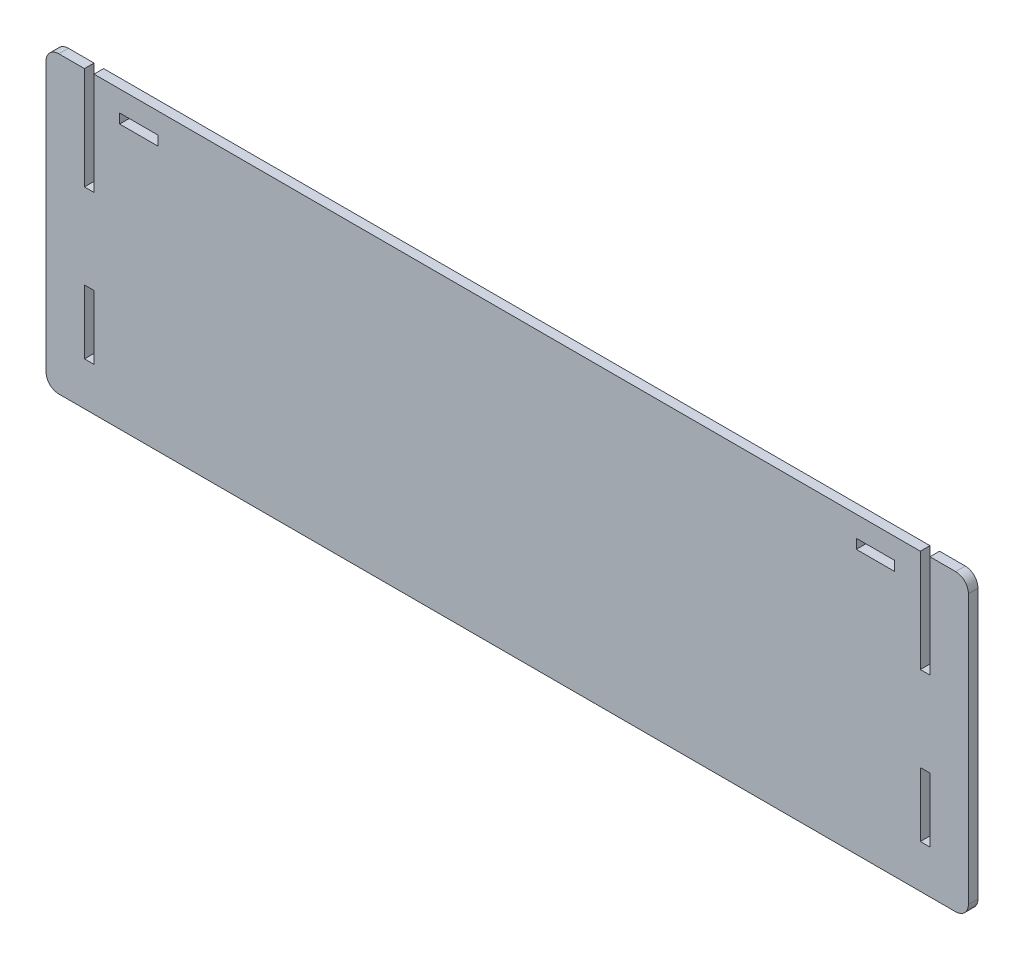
from build123d import *

# Parameters (mm, degrees)
SKETCH2_W           = 1828.8
SKETCH2_H           = 584.2
BOSS_EXTRUDE1_DEPTH = 19.05
SKETCH3_W           = 19.05
SKETCH3_H           = 203.2
CUT_EXTRUDE1_DEPTH  = 961.110760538
FILLET1_R           = 25.4
SKETCH6_W           = 19.05
SKETCH6_H           = 127
CUT_EXTRUDE4_DEPTH  = 961.110760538
SKETCH7_W           = 76.2
SKETCH7_H           = 19.05
CUT_EXTRUDE5_DEPTH  = 961.110760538


with BuildPart() as part:
    # Sketch2 → Boss-Extrude1 (new body)
    with BuildSketch(Plane.XY):
        Rectangle(SKETCH2_W, SKETCH2_H)
    extrude(amount=BOSS_EXTRUDE1_DEPTH)

    # Sketch3 → Cut-Extrude1 (cut, through all)
    with BuildSketch(Plane(origin=(0, 0, 0), x_dir=(-1, 0, 0), z_dir=(0, 0, -1))):
        with Locations((-828.675, 190.5)):
            Rectangle(SKETCH3_W, SKETCH3_H)
    cut_extrude1 = extrude(amount=-CUT_EXTRUDE1_DEPTH, mode=Mode.SUBTRACT)

    # Fillet1
    fillet1_edges = [part.edges().sort_by_distance(p)[0] for p in [
        (914.4, -292.1, 9.525),
        (-914.4, -292.1, 9.525),
        (-914.4, 292.1, 9.525),
        (914.4, 292.1, 9.525),
    ]]
    fillet(fillet1_edges, radius=FILLET1_R)

    # Mirror3: Cut-Extrude1 across plane
    add(cut_extrude1.mirror(Plane(origin=(0, 0, 0), x_dir=(0, 0, 1), z_dir=(1, 0, 0))), mode=Mode.SUBTRACT)

    # Sketch6 → Cut-Extrude4 (cut, through all)
    with BuildSketch(Plane(origin=(0, 0, 0), x_dir=(-1, 0, 0), z_dir=(0, 0, -1))):
        with Locations((-828.675, -142.875)):
            Rectangle(SKETCH6_W, SKETCH6_H)
    cut_extrude4 = extrude(amount=-CUT_EXTRUDE4_DEPTH, mode=Mode.SUBTRACT)

    # Mirror4: Cut-Extrude4 across plane
    add(cut_extrude4.mirror(Plane(origin=(0, 0, 0), x_dir=(0, 0, 1), z_dir=(1, 0, 0))), mode=Mode.SUBTRACT)

    # Sketch7 → Cut-Extrude5 (cut, through all)
    with BuildSketch(Plane(origin=(0, 0, 0), x_dir=(-1, 0, 0), z_dir=(0, 0, -1))):
        with Locations((-730.25, 241.3)):
            Rectangle(SKETCH7_W, SKETCH7_H)
    cut_extrude5 = extrude(amount=-CUT_EXTRUDE5_DEPTH, mode=Mode.SUBTRACT)

    # Mirror5: Cut-Extrude5 across plane
    add(cut_extrude5.mirror(Plane(origin=(0, 0, 0), x_dir=(0, 0, 1), z_dir=(1, 0, 0))), mode=Mode.SUBTRACT)


solid = part.part
